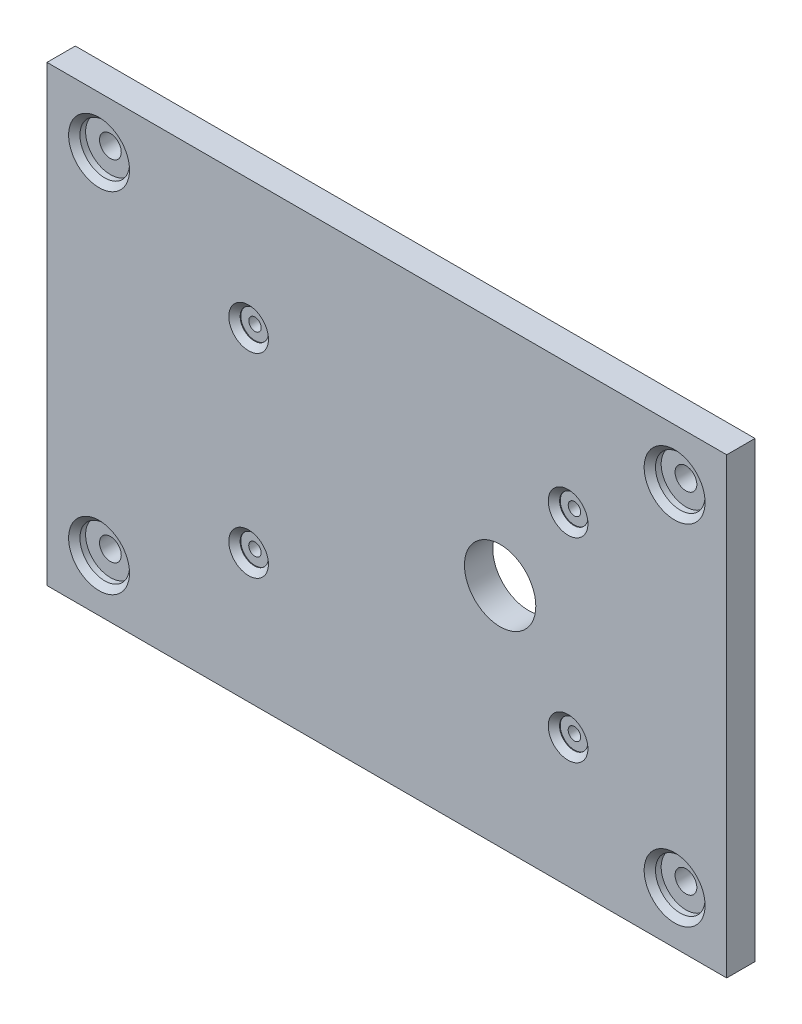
ISO-10303-21;
HEADER;
FILE_DESCRIPTION(('STEP AP214'),'2;1');
FILE_NAME('part.step','',(''),(''),'','','');
FILE_SCHEMA(('AUTOMOTIVE_DESIGN { 1 0 10303 214 1 1 1 1 }'));
ENDSEC;
DATA;
#1=APPLICATION_CONTEXT('core data for automotive mechanical design processes');
#2=APPLICATION_PROTOCOL_DEFINITION('international standard','automotive_design',2000,#1);
#3=PRODUCT_CONTEXT('',#1,'mechanical');
#4=PRODUCT('Part','Part','',(#3));
#5=PRODUCT_RELATED_PRODUCT_CATEGORY('part','',(#4));
#6=PRODUCT_DEFINITION_FORMATION('','',#4);
#7=PRODUCT_DEFINITION_CONTEXT('part definition',#1,'design');
#8=PRODUCT_DEFINITION('design','',#6,#7);
#9=PRODUCT_DEFINITION_SHAPE('','',#8);
#10=(LENGTH_UNIT() NAMED_UNIT(*) SI_UNIT(.MILLI.,.METRE.));
#11=(NAMED_UNIT(*) PLANE_ANGLE_UNIT() SI_UNIT($,.RADIAN.));
#12=(NAMED_UNIT(*) SI_UNIT($,.STERADIAN.) SOLID_ANGLE_UNIT());
#13=UNCERTAINTY_MEASURE_WITH_UNIT(LENGTH_MEASURE(1.E-05),#10,'distance_accuracy_value','');
#14=(GEOMETRIC_REPRESENTATION_CONTEXT(3) GLOBAL_UNCERTAINTY_ASSIGNED_CONTEXT((#13)) GLOBAL_UNIT_ASSIGNED_CONTEXT((#10,
#11,#12)) REPRESENTATION_CONTEXT('',''));
#15=CARTESIAN_POINT('',(0.,0.,0.));
#16=DIRECTION('',(0.,0.,1.));
#17=DIRECTION('',(1.,0.,0.));
#18=AXIS2_PLACEMENT_3D('',#15,#16,#17);
#19=CARTESIAN_POINT('',(0.,0.,3.175));
#20=DIRECTION('',(1.,0.,0.));
#21=DIRECTION('',(0.,0.,-1.));
#22=AXIS2_PLACEMENT_3D('',#19,#20,#21);
#23=PLANE('',#22);
#24=DIRECTION('',(0.,-1.,0.));
#25=VECTOR('',#24,1.);
#26=CARTESIAN_POINT('',(0.,0.,0.));
#27=LINE('',#26,#25);
#28=CARTESIAN_POINT('',(0.,50.8,0.));
#29=VERTEX_POINT('',#28);
#30=CARTESIAN_POINT('',(0.,0.,0.));
#31=VERTEX_POINT('',#30);
#32=EDGE_CURVE('E116',#29,#31,#27,.T.);
#33=ORIENTED_EDGE('',*,*,#32,.T.);
#34=DIRECTION('',(0.,0.,-1.));
#35=VECTOR('',#34,1.);
#36=CARTESIAN_POINT('',(0.,0.,3.175));
#37=LINE('',#36,#35);
#38=CARTESIAN_POINT('',(0.,0.,3.175));
#39=VERTEX_POINT('',#38);
#40=EDGE_CURVE('E11',#39,#31,#37,.T.);
#41=ORIENTED_EDGE('',*,*,#40,.F.);
#42=DIRECTION('',(0.,-1.,0.));
#43=VECTOR('',#42,1.);
#44=CARTESIAN_POINT('',(0.,0.,3.175));
#45=LINE('',#44,#43);
#46=CARTESIAN_POINT('',(0.,50.8,3.175));
#47=VERTEX_POINT('',#46);
#48=EDGE_CURVE('E99',#47,#39,#45,.T.);
#49=ORIENTED_EDGE('',*,*,#48,.F.);
#50=DIRECTION('',(0.,0.,-1.));
#51=VECTOR('',#50,1.);
#52=CARTESIAN_POINT('',(0.,50.8,3.175));
#53=LINE('',#52,#51);
#54=EDGE_CURVE('E112',#47,#29,#53,.T.);
#55=ORIENTED_EDGE('',*,*,#54,.T.);
#56=EDGE_LOOP('',(#33,#41,#49,#55));
#57=FACE_BOUND('',#56,.T.);
#58=ADVANCED_FACE('F45',(#57),#23,.F.);
#59=CARTESIAN_POINT('',(0.,0.,3.175));
#60=DIRECTION('',(0.,1.,0.));
#61=DIRECTION('',(0.,0.,1.));
#62=AXIS2_PLACEMENT_3D('',#59,#60,#61);
#63=PLANE('',#62);
#64=DIRECTION('',(1.,0.,0.));
#65=VECTOR('',#64,1.);
#66=CARTESIAN_POINT('',(0.,0.,0.));
#67=LINE('',#66,#65);
#68=CARTESIAN_POINT('',(76.2,0.,0.));
#69=VERTEX_POINT('',#68);
#70=EDGE_CURVE('E104',#31,#69,#67,.T.);
#71=ORIENTED_EDGE('',*,*,#70,.T.);
#72=DIRECTION('',(0.,0.,-1.));
#73=VECTOR('',#72,1.);
#74=CARTESIAN_POINT('',(76.2,0.,3.175));
#75=LINE('',#74,#73);
#76=CARTESIAN_POINT('',(76.2,0.,3.175));
#77=VERTEX_POINT('',#76);
#78=EDGE_CURVE('E55',#77,#69,#75,.T.);
#79=ORIENTED_EDGE('',*,*,#78,.F.);
#80=DIRECTION('',(1.,0.,0.));
#81=VECTOR('',#80,1.);
#82=CARTESIAN_POINT('',(0.,0.,3.175));
#83=LINE('',#82,#81);
#84=EDGE_CURVE('E94',#39,#77,#83,.T.);
#85=ORIENTED_EDGE('',*,*,#84,.F.);
#86=ORIENTED_EDGE('',*,*,#40,.T.);
#87=EDGE_LOOP('',(#71,#79,#85,#86));
#88=FACE_BOUND('',#87,.T.);
#89=ADVANCED_FACE('F103',(#88),#63,.F.);
#90=CARTESIAN_POINT('',(76.2,0.,3.175));
#91=DIRECTION('',(-1.,0.,0.));
#92=DIRECTION('',(0.,0.,1.));
#93=AXIS2_PLACEMENT_3D('',#90,#91,#92);
#94=PLANE('',#93);
#95=DIRECTION('',(0.,1.,0.));
#96=VECTOR('',#95,1.);
#97=CARTESIAN_POINT('',(76.2,0.,0.));
#98=LINE('',#97,#96);
#99=CARTESIAN_POINT('',(76.2,50.8,0.));
#100=VERTEX_POINT('',#99);
#101=EDGE_CURVE('E81',#69,#100,#98,.T.);
#102=ORIENTED_EDGE('',*,*,#101,.T.);
#103=DIRECTION('',(0.,0.,-1.));
#104=VECTOR('',#103,1.);
#105=CARTESIAN_POINT('',(76.2,50.8,3.175));
#106=LINE('',#105,#104);
#107=CARTESIAN_POINT('',(76.2,50.8,3.175));
#108=VERTEX_POINT('',#107);
#109=EDGE_CURVE('E106',#108,#100,#106,.T.);
#110=ORIENTED_EDGE('',*,*,#109,.F.);
#111=DIRECTION('',(0.,1.,0.));
#112=VECTOR('',#111,1.);
#113=CARTESIAN_POINT('',(76.2,0.,3.175));
#114=LINE('',#113,#112);
#115=EDGE_CURVE('E97',#77,#108,#114,.T.);
#116=ORIENTED_EDGE('',*,*,#115,.F.);
#117=ORIENTED_EDGE('',*,*,#78,.T.);
#118=EDGE_LOOP('',(#102,#110,#116,#117));
#119=FACE_BOUND('',#118,.T.);
#120=ADVANCED_FACE('F108',(#119),#94,.F.);
#121=CARTESIAN_POINT('',(0.,50.8,3.175));
#122=DIRECTION('',(0.,-1.,0.));
#123=DIRECTION('',(0.,0.,-1.));
#124=AXIS2_PLACEMENT_3D('',#121,#122,#123);
#125=PLANE('',#124);
#126=DIRECTION('',(-1.,0.,0.));
#127=VECTOR('',#126,1.);
#128=CARTESIAN_POINT('',(0.,50.8,0.));
#129=LINE('',#128,#127);
#130=EDGE_CURVE('E87',#100,#29,#129,.T.);
#131=ORIENTED_EDGE('',*,*,#130,.T.);
#132=ORIENTED_EDGE('',*,*,#54,.F.);
#133=DIRECTION('',(-1.,0.,0.));
#134=VECTOR('',#133,1.);
#135=CARTESIAN_POINT('',(0.,50.8,3.175));
#136=LINE('',#135,#134);
#137=EDGE_CURVE('E64',#108,#47,#136,.T.);
#138=ORIENTED_EDGE('',*,*,#137,.F.);
#139=ORIENTED_EDGE('',*,*,#109,.T.);
#140=EDGE_LOOP('',(#131,#132,#138,#139));
#141=FACE_BOUND('',#140,.T.);
#142=ADVANCED_FACE('F300',(#141),#125,.F.);
#143=CARTESIAN_POINT('',(0.,0.,3.175));
#144=DIRECTION('',(0.,0.,-1.));
#145=DIRECTION('',(-1.,0.,0.));
#146=AXIS2_PLACEMENT_3D('',#143,#144,#145);
#147=PLANE('',#146);
#148=CARTESIAN_POINT('',(22.6068122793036,36.3240964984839,3.175));
#149=DIRECTION('',(0.,0.,1.));
#150=DIRECTION('',(1.,0.,0.));
#151=AXIS2_PLACEMENT_3D('',#148,#149,#150);
#152=CIRCLE('',#151,2.2225);
#153=CARTESIAN_POINT('',(24.8293122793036,36.3240964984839,3.175));
#154=VERTEX_POINT('',#153);
#155=EDGE_CURVE('E638',#154,#154,#152,.T.);
#156=ORIENTED_EDGE('',*,*,#155,.F.);
#157=EDGE_LOOP('',(#156));
#158=FACE_BOUND('',#157,.T.);
#159=CARTESIAN_POINT('',(22.6030007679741,14.4857454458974,3.175));
#160=DIRECTION('',(0.,0.,1.));
#161=DIRECTION('',(1.,0.,0.));
#162=AXIS2_PLACEMENT_3D('',#159,#160,#161);
#163=CIRCLE('',#162,2.2225);
#164=CARTESIAN_POINT('',(24.8255007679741,14.4857454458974,3.175));
#165=VERTEX_POINT('',#164);
#166=EDGE_CURVE('E652',#165,#165,#163,.T.);
#167=ORIENTED_EDGE('',*,*,#166,.F.);
#168=EDGE_LOOP('',(#167));
#169=FACE_BOUND('',#168,.T.);
#170=CARTESIAN_POINT('',(58.4214304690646,36.3210018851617,3.175));
#171=DIRECTION('',(0.,0.,1.));
#172=DIRECTION('',(1.,0.,0.));
#173=AXIS2_PLACEMENT_3D('',#170,#171,#172);
#174=CIRCLE('',#173,2.2225);
#175=CARTESIAN_POINT('',(60.6439304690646,36.3210018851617,3.175));
#176=VERTEX_POINT('',#175);
#177=EDGE_CURVE('E167',#176,#176,#174,.T.);
#178=ORIENTED_EDGE('',*,*,#177,.F.);
#179=EDGE_LOOP('',(#178));
#180=FACE_BOUND('',#179,.T.);
#181=CARTESIAN_POINT('',(58.4176178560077,14.4763383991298,3.175));
#182=DIRECTION('',(0.,0.,1.));
#183=DIRECTION('',(1.,0.,0.));
#184=AXIS2_PLACEMENT_3D('',#181,#182,#183);
#185=CIRCLE('',#184,2.2225);
#186=CARTESIAN_POINT('',(60.6401178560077,14.4763383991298,3.175));
#187=VERTEX_POINT('',#186);
#188=EDGE_CURVE('E162',#187,#187,#185,.T.);
#189=ORIENTED_EDGE('',*,*,#188,.F.);
#190=EDGE_LOOP('',(#189));
#191=FACE_BOUND('',#190,.T.);
#192=CARTESIAN_POINT('',(50.8,25.4,3.175));
#193=DIRECTION('',(0.,0.,1.));
#194=DIRECTION('',(1.,0.,0.));
#195=AXIS2_PLACEMENT_3D('',#192,#193,#194);
#196=CIRCLE('',#195,4.0005);
#197=CARTESIAN_POINT('',(54.8005,25.4,3.175));
#198=VERTEX_POINT('',#197);
#199=EDGE_CURVE('E157',#198,#198,#196,.T.);
#200=ORIENTED_EDGE('',*,*,#199,.F.);
#201=EDGE_LOOP('',(#200));
#202=FACE_BOUND('',#201,.T.);
#203=CARTESIAN_POINT('',(5.83716647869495,44.9628335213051,3.175));
#204=DIRECTION('',(0.,0.,1.));
#205=DIRECTION('',(1.,0.,0.));
#206=AXIS2_PLACEMENT_3D('',#203,#204,#205);
#207=CIRCLE('',#206,3.41376);
#208=CARTESIAN_POINT('',(9.25092647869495,44.9628335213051,3.175));
#209=VERTEX_POINT('',#208);
#210=EDGE_CURVE('E215',#209,#209,#207,.T.);
#211=ORIENTED_EDGE('',*,*,#210,.F.);
#212=EDGE_LOOP('',(#211));
#213=FACE_BOUND('',#212,.T.);
#214=CARTESIAN_POINT('',(70.362833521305,44.9628335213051,3.175));
#215=DIRECTION('',(0.,0.,1.));
#216=DIRECTION('',(1.,0.,0.));
#217=AXIS2_PLACEMENT_3D('',#214,#215,#216);
#218=CIRCLE('',#217,3.41376);
#219=CARTESIAN_POINT('',(73.776593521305,44.9628335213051,3.175));
#220=VERTEX_POINT('',#219);
#221=EDGE_CURVE('E151',#220,#220,#218,.T.);
#222=ORIENTED_EDGE('',*,*,#221,.F.);
#223=EDGE_LOOP('',(#222));
#224=FACE_BOUND('',#223,.T.);
#225=CARTESIAN_POINT('',(5.83716647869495,5.83716647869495,3.175));
#226=DIRECTION('',(0.,0.,1.));
#227=DIRECTION('',(1.,0.,0.));
#228=AXIS2_PLACEMENT_3D('',#225,#226,#227);
#229=CIRCLE('',#228,3.41376);
#230=CARTESIAN_POINT('',(9.25092647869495,5.83716647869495,3.175));
#231=VERTEX_POINT('',#230);
#232=EDGE_CURVE('E145',#231,#231,#229,.T.);
#233=ORIENTED_EDGE('',*,*,#232,.F.);
#234=EDGE_LOOP('',(#233));
#235=FACE_BOUND('',#234,.T.);
#236=CARTESIAN_POINT('',(70.362833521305,5.83716647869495,3.175));
#237=DIRECTION('',(0.,0.,1.));
#238=DIRECTION('',(1.,0.,0.));
#239=AXIS2_PLACEMENT_3D('',#236,#237,#238);
#240=CIRCLE('',#239,3.41376);
#241=CARTESIAN_POINT('',(73.776593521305,5.83716647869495,3.175));
#242=VERTEX_POINT('',#241);
#243=EDGE_CURVE('E139',#242,#242,#240,.T.);
#244=ORIENTED_EDGE('',*,*,#243,.F.);
#245=EDGE_LOOP('',(#244));
#246=FACE_BOUND('',#245,.T.);
#247=ORIENTED_EDGE('',*,*,#48,.T.);
#248=ORIENTED_EDGE('',*,*,#84,.T.);
#249=ORIENTED_EDGE('',*,*,#115,.T.);
#250=ORIENTED_EDGE('',*,*,#137,.T.);
#251=EDGE_LOOP('',(#247,#248,#249,#250));
#252=FACE_BOUND('',#251,.T.);
#253=ADVANCED_FACE('F95',(#158,#169,#180,#191,#202,#213,#224,#235,#246,#252),#147,.F.);
#254=CARTESIAN_POINT('',(0.,0.,0.));
#255=DIRECTION('',(0.,0.,-1.));
#256=DIRECTION('',(-1.,0.,0.));
#257=AXIS2_PLACEMENT_3D('',#254,#255,#256);
#258=PLANE('',#257);
#259=CARTESIAN_POINT('',(22.6068122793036,36.3240964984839,0.));
#260=DIRECTION('',(0.,0.,-1.));
#261=DIRECTION('',(-1.,0.,0.));
#262=AXIS2_PLACEMENT_3D('',#259,#260,#261);
#263=CIRCLE('',#262,0.698499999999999);
#264=CARTESIAN_POINT('',(21.9083122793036,36.3240964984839,0.));
#265=VERTEX_POINT('',#264);
#266=EDGE_CURVE('E48',#265,#265,#263,.T.);
#267=ORIENTED_EDGE('',*,*,#266,.F.);
#268=EDGE_LOOP('',(#267));
#269=FACE_BOUND('',#268,.T.);
#270=CARTESIAN_POINT('',(22.6030007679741,14.4857454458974,0.));
#271=DIRECTION('',(0.,0.,-1.));
#272=DIRECTION('',(-1.,0.,0.));
#273=AXIS2_PLACEMENT_3D('',#270,#271,#272);
#274=CIRCLE('',#273,0.698499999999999);
#275=CARTESIAN_POINT('',(21.9045007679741,14.4857454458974,0.));
#276=VERTEX_POINT('',#275);
#277=EDGE_CURVE('E164',#276,#276,#274,.T.);
#278=ORIENTED_EDGE('',*,*,#277,.F.);
#279=EDGE_LOOP('',(#278));
#280=FACE_BOUND('',#279,.T.);
#281=CARTESIAN_POINT('',(58.4214304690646,36.3210018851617,0.));
#282=DIRECTION('',(0.,0.,-1.));
#283=DIRECTION('',(-1.,0.,0.));
#284=AXIS2_PLACEMENT_3D('',#281,#282,#283);
#285=CIRCLE('',#284,0.698500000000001);
#286=CARTESIAN_POINT('',(57.7229304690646,36.3210018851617,0.));
#287=VERTEX_POINT('',#286);
#288=EDGE_CURVE('E159',#287,#287,#285,.T.);
#289=ORIENTED_EDGE('',*,*,#288,.F.);
#290=EDGE_LOOP('',(#289));
#291=FACE_BOUND('',#290,.T.);
#292=CARTESIAN_POINT('',(58.4176178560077,14.4763383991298,0.));
#293=DIRECTION('',(0.,0.,-1.));
#294=DIRECTION('',(-1.,0.,0.));
#295=AXIS2_PLACEMENT_3D('',#292,#293,#294);
#296=CIRCLE('',#295,0.698500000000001);
#297=CARTESIAN_POINT('',(57.7191178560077,14.4763383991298,0.));
#298=VERTEX_POINT('',#297);
#299=EDGE_CURVE('E153',#298,#298,#296,.T.);
#300=ORIENTED_EDGE('',*,*,#299,.F.);
#301=EDGE_LOOP('',(#300));
#302=FACE_BOUND('',#301,.T.);
#303=CARTESIAN_POINT('',(50.8,25.4,0.));
#304=DIRECTION('',(0.,0.,1.));
#305=DIRECTION('',(1.,0.,0.));
#306=AXIS2_PLACEMENT_3D('',#303,#304,#305);
#307=CIRCLE('',#306,4.0005);
#308=CARTESIAN_POINT('',(54.8005,25.4,0.));
#309=VERTEX_POINT('',#308);
#310=EDGE_CURVE('E211',#309,#309,#307,.T.);
#311=ORIENTED_EDGE('',*,*,#310,.T.);
#312=EDGE_LOOP('',(#311));
#313=FACE_BOUND('',#312,.T.);
#314=CARTESIAN_POINT('',(5.83716647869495,44.9628335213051,0.));
#315=DIRECTION('',(0.,0.,-1.));
#316=DIRECTION('',(-1.,0.,0.));
#317=AXIS2_PLACEMENT_3D('',#314,#315,#316);
#318=CIRCLE('',#317,1.2192);
#319=CARTESIAN_POINT('',(4.61796647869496,44.9628335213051,0.));
#320=VERTEX_POINT('',#319);
#321=EDGE_CURVE('E147',#320,#320,#318,.T.);
#322=ORIENTED_EDGE('',*,*,#321,.F.);
#323=EDGE_LOOP('',(#322));
#324=FACE_BOUND('',#323,.T.);
#325=CARTESIAN_POINT('',(70.362833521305,44.9628335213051,0.));
#326=DIRECTION('',(0.,0.,-1.));
#327=DIRECTION('',(-1.,0.,0.));
#328=AXIS2_PLACEMENT_3D('',#325,#326,#327);
#329=CIRCLE('',#328,1.2192);
#330=CARTESIAN_POINT('',(69.143633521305,44.9628335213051,0.));
#331=VERTEX_POINT('',#330);
#332=EDGE_CURVE('E141',#331,#331,#329,.T.);
#333=ORIENTED_EDGE('',*,*,#332,.F.);
#334=EDGE_LOOP('',(#333));
#335=FACE_BOUND('',#334,.T.);
#336=CARTESIAN_POINT('',(5.83716647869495,5.83716647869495,0.));
#337=DIRECTION('',(0.,0.,-1.));
#338=DIRECTION('',(-1.,0.,0.));
#339=AXIS2_PLACEMENT_3D('',#336,#337,#338);
#340=CIRCLE('',#339,1.2192);
#341=CARTESIAN_POINT('',(4.61796647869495,5.83716647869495,0.));
#342=VERTEX_POINT('',#341);
#343=EDGE_CURVE('E135',#342,#342,#340,.T.);
#344=ORIENTED_EDGE('',*,*,#343,.F.);
#345=EDGE_LOOP('',(#344));
#346=FACE_BOUND('',#345,.T.);
#347=CARTESIAN_POINT('',(70.362833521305,5.83716647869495,0.));
#348=DIRECTION('',(0.,0.,-1.));
#349=DIRECTION('',(-1.,0.,0.));
#350=AXIS2_PLACEMENT_3D('',#347,#348,#349);
#351=CIRCLE('',#350,1.2192);
#352=CARTESIAN_POINT('',(69.143633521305,5.83716647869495,0.));
#353=VERTEX_POINT('',#352);
#354=EDGE_CURVE('E120',#353,#353,#351,.T.);
#355=ORIENTED_EDGE('',*,*,#354,.F.);
#356=EDGE_LOOP('',(#355));
#357=FACE_BOUND('',#356,.T.);
#358=ORIENTED_EDGE('',*,*,#32,.F.);
#359=ORIENTED_EDGE('',*,*,#130,.F.);
#360=ORIENTED_EDGE('',*,*,#101,.F.);
#361=ORIENTED_EDGE('',*,*,#70,.F.);
#362=EDGE_LOOP('',(#358,#359,#360,#361));
#363=FACE_BOUND('',#362,.T.);
#364=ADVANCED_FACE('F299',(#269,#280,#291,#302,#313,#324,#335,#346,#357,#363),#258,.T.);
#365=CARTESIAN_POINT('',(70.362833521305,5.83716647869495,3.175));
#366=DIRECTION('',(0.,0.,1.));
#367=DIRECTION('',(1.,0.,0.));
#368=AXIS2_PLACEMENT_3D('',#365,#366,#367);
#369=CYLINDRICAL_SURFACE('',#368,1.2192);
#370=ORIENTED_EDGE('',*,*,#354,.T.);
#371=EDGE_LOOP('',(#370));
#372=FACE_BOUND('',#371,.T.);
#373=CARTESIAN_POINT('',(70.362833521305,5.83716647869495,1.905));
#374=DIRECTION('',(0.,0.,1.));
#375=DIRECTION('',(1.,0.,0.));
#376=AXIS2_PLACEMENT_3D('',#373,#374,#375);
#377=CIRCLE('',#376,1.2192);
#378=CARTESIAN_POINT('',(71.582033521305,5.83716647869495,1.905));
#379=VERTEX_POINT('',#378);
#380=EDGE_CURVE('E134',#379,#379,#377,.T.);
#381=ORIENTED_EDGE('',*,*,#380,.T.);
#382=EDGE_LOOP('',(#381));
#383=FACE_BOUND('',#382,.T.);
#384=ADVANCED_FACE('F277',(#372,#383),#369,.F.);
#385=CARTESIAN_POINT('',(71.582033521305,5.83716647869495,1.905));
#386=DIRECTION('',(0.,0.,-1.));
#387=DIRECTION('',(-1.,0.,0.));
#388=AXIS2_PLACEMENT_3D('',#385,#386,#387);
#389=PLANE('',#388);
#390=ORIENTED_EDGE('',*,*,#380,.F.);
#391=EDGE_LOOP('',(#390));
#392=FACE_BOUND('',#391,.T.);
#393=CARTESIAN_POINT('',(70.362833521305,5.83716647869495,1.905));
#394=DIRECTION('',(0.,0.,1.));
#395=DIRECTION('',(1.,0.,0.));
#396=AXIS2_PLACEMENT_3D('',#393,#394,#395);
#397=CIRCLE('',#396,2.77876000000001);
#398=CARTESIAN_POINT('',(73.141593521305,5.83716647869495,1.905));
#399=VERTEX_POINT('',#398);
#400=EDGE_CURVE('E268',#399,#399,#397,.T.);
#401=ORIENTED_EDGE('',*,*,#400,.T.);
#402=EDGE_LOOP('',(#401));
#403=FACE_BOUND('',#402,.T.);
#404=ADVANCED_FACE('F279',(#392,#403),#389,.F.);
#405=CARTESIAN_POINT('',(70.362833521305,5.83716647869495,3.175));
#406=DIRECTION('',(0.,0.,1.));
#407=DIRECTION('',(1.,0.,0.));
#408=AXIS2_PLACEMENT_3D('',#405,#406,#407);
#409=CYLINDRICAL_SURFACE('',#408,2.77876000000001);
#410=ORIENTED_EDGE('',*,*,#400,.F.);
#411=EDGE_LOOP('',(#410));
#412=FACE_BOUND('',#411,.T.);
#413=CARTESIAN_POINT('',(70.362833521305,5.83716647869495,2.54));
#414=DIRECTION('',(0.,0.,1.));
#415=DIRECTION('',(1.,0.,0.));
#416=AXIS2_PLACEMENT_3D('',#413,#414,#415);
#417=CIRCLE('',#416,2.77876000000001);
#418=CARTESIAN_POINT('',(73.141593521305,5.83716647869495,2.54));
#419=VERTEX_POINT('',#418);
#420=EDGE_CURVE('E264',#419,#419,#417,.T.);
#421=ORIENTED_EDGE('',*,*,#420,.T.);
#422=EDGE_LOOP('',(#421));
#423=FACE_BOUND('',#422,.T.);
#424=ADVANCED_FACE('F282',(#412,#423),#409,.F.);
#425=CARTESIAN_POINT('',(70.362833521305,5.83716647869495,3.175));
#426=DIRECTION('',(0.,0.,1.));
#427=DIRECTION('',(1.,0.,0.));
#428=AXIS2_PLACEMENT_3D('',#425,#426,#427);
#429=CONICAL_SURFACE('',#428,3.41376,0.785398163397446);
#430=ORIENTED_EDGE('',*,*,#420,.F.);
#431=EDGE_LOOP('',(#430));
#432=FACE_BOUND('',#431,.T.);
#433=ORIENTED_EDGE('',*,*,#243,.T.);
#434=EDGE_LOOP('',(#433));
#435=FACE_BOUND('',#434,.T.);
#436=ADVANCED_FACE('F288',(#432,#435),#429,.F.);
#437=CARTESIAN_POINT('',(5.83716647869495,5.83716647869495,3.175));
#438=DIRECTION('',(0.,0.,1.));
#439=DIRECTION('',(1.,0.,0.));
#440=AXIS2_PLACEMENT_3D('',#437,#438,#439);
#441=CYLINDRICAL_SURFACE('',#440,1.2192);
#442=ORIENTED_EDGE('',*,*,#343,.T.);
#443=EDGE_LOOP('',(#442));
#444=FACE_BOUND('',#443,.T.);
#445=CARTESIAN_POINT('',(5.83716647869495,5.83716647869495,1.905));
#446=DIRECTION('',(0.,0.,1.));
#447=DIRECTION('',(1.,0.,0.));
#448=AXIS2_PLACEMENT_3D('',#445,#446,#447);
#449=CIRCLE('',#448,1.2192);
#450=CARTESIAN_POINT('',(7.05636647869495,5.83716647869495,1.905));
#451=VERTEX_POINT('',#450);
#452=EDGE_CURVE('E140',#451,#451,#449,.T.);
#453=ORIENTED_EDGE('',*,*,#452,.T.);
#454=EDGE_LOOP('',(#453));
#455=FACE_BOUND('',#454,.T.);
#456=ADVANCED_FACE('F294',(#444,#455),#441,.F.);
#457=CARTESIAN_POINT('',(7.05636647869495,5.83716647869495,1.905));
#458=DIRECTION('',(0.,0.,-1.));
#459=DIRECTION('',(-1.,0.,0.));
#460=AXIS2_PLACEMENT_3D('',#457,#458,#459);
#461=PLANE('',#460);
#462=ORIENTED_EDGE('',*,*,#452,.F.);
#463=EDGE_LOOP('',(#462));
#464=FACE_BOUND('',#463,.T.);
#465=CARTESIAN_POINT('',(5.83716647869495,5.83716647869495,1.905));
#466=DIRECTION('',(0.,0.,1.));
#467=DIRECTION('',(1.,0.,0.));
#468=AXIS2_PLACEMENT_3D('',#465,#466,#467);
#469=CIRCLE('',#468,2.77876);
#470=CARTESIAN_POINT('',(8.61592647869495,5.83716647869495,1.905));
#471=VERTEX_POINT('',#470);
#472=EDGE_CURVE('E254',#471,#471,#469,.T.);
#473=ORIENTED_EDGE('',*,*,#472,.T.);
#474=EDGE_LOOP('',(#473));
#475=FACE_BOUND('',#474,.T.);
#476=ADVANCED_FACE('F362',(#464,#475),#461,.F.);
#477=CARTESIAN_POINT('',(5.83716647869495,5.83716647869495,3.175));
#478=DIRECTION('',(0.,0.,1.));
#479=DIRECTION('',(1.,0.,0.));
#480=AXIS2_PLACEMENT_3D('',#477,#478,#479);
#481=CYLINDRICAL_SURFACE('',#480,2.77876);
#482=ORIENTED_EDGE('',*,*,#472,.F.);
#483=EDGE_LOOP('',(#482));
#484=FACE_BOUND('',#483,.T.);
#485=CARTESIAN_POINT('',(5.83716647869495,5.83716647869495,2.54));
#486=DIRECTION('',(0.,0.,1.));
#487=DIRECTION('',(1.,0.,0.));
#488=AXIS2_PLACEMENT_3D('',#485,#486,#487);
#489=CIRCLE('',#488,2.77876);
#490=CARTESIAN_POINT('',(8.61592647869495,5.83716647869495,2.54));
#491=VERTEX_POINT('',#490);
#492=EDGE_CURVE('E250',#491,#491,#489,.T.);
#493=ORIENTED_EDGE('',*,*,#492,.T.);
#494=EDGE_LOOP('',(#493));
#495=FACE_BOUND('',#494,.T.);
#496=ADVANCED_FACE('F371',(#484,#495),#481,.F.);
#497=CARTESIAN_POINT('',(5.83716647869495,5.83716647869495,3.175));
#498=DIRECTION('',(0.,0.,1.));
#499=DIRECTION('',(1.,0.,0.));
#500=AXIS2_PLACEMENT_3D('',#497,#498,#499);
#501=CONICAL_SURFACE('',#500,3.41376,0.785398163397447);
#502=ORIENTED_EDGE('',*,*,#492,.F.);
#503=EDGE_LOOP('',(#502));
#504=FACE_BOUND('',#503,.T.);
#505=ORIENTED_EDGE('',*,*,#232,.T.);
#506=EDGE_LOOP('',(#505));
#507=FACE_BOUND('',#506,.T.);
#508=ADVANCED_FACE('F380',(#504,#507),#501,.F.);
#509=CARTESIAN_POINT('',(70.362833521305,44.9628335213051,3.175));
#510=DIRECTION('',(0.,0.,1.));
#511=DIRECTION('',(1.,0.,0.));
#512=AXIS2_PLACEMENT_3D('',#509,#510,#511);
#513=CYLINDRICAL_SURFACE('',#512,1.2192);
#514=ORIENTED_EDGE('',*,*,#332,.T.);
#515=EDGE_LOOP('',(#514));
#516=FACE_BOUND('',#515,.T.);
#517=CARTESIAN_POINT('',(70.362833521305,44.9628335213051,1.905));
#518=DIRECTION('',(0.,0.,1.));
#519=DIRECTION('',(1.,0.,0.));
#520=AXIS2_PLACEMENT_3D('',#517,#518,#519);
#521=CIRCLE('',#520,1.2192);
#522=CARTESIAN_POINT('',(71.582033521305,44.9628335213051,1.905));
#523=VERTEX_POINT('',#522);
#524=EDGE_CURVE('E146',#523,#523,#521,.T.);
#525=ORIENTED_EDGE('',*,*,#524,.T.);
#526=EDGE_LOOP('',(#525));
#527=FACE_BOUND('',#526,.T.);
#528=ADVANCED_FACE('F389',(#516,#527),#513,.F.);
#529=CARTESIAN_POINT('',(71.582033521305,44.9628335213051,1.905));
#530=DIRECTION('',(0.,0.,-1.));
#531=DIRECTION('',(-1.,0.,0.));
#532=AXIS2_PLACEMENT_3D('',#529,#530,#531);
#533=PLANE('',#532);
#534=ORIENTED_EDGE('',*,*,#524,.F.);
#535=EDGE_LOOP('',(#534));
#536=FACE_BOUND('',#535,.T.);
#537=CARTESIAN_POINT('',(70.362833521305,44.9628335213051,1.905));
#538=DIRECTION('',(0.,0.,1.));
#539=DIRECTION('',(1.,0.,0.));
#540=AXIS2_PLACEMENT_3D('',#537,#538,#539);
#541=CIRCLE('',#540,2.77876000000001);
#542=CARTESIAN_POINT('',(73.141593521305,44.9628335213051,1.905));
#543=VERTEX_POINT('',#542);
#544=EDGE_CURVE('E240',#543,#543,#541,.T.);
#545=ORIENTED_EDGE('',*,*,#544,.T.);
#546=EDGE_LOOP('',(#545));
#547=FACE_BOUND('',#546,.T.);
#548=ADVANCED_FACE('F398',(#536,#547),#533,.F.);
#549=CARTESIAN_POINT('',(70.362833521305,44.9628335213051,3.175));
#550=DIRECTION('',(0.,0.,1.));
#551=DIRECTION('',(1.,0.,0.));
#552=AXIS2_PLACEMENT_3D('',#549,#550,#551);
#553=CYLINDRICAL_SURFACE('',#552,2.77876000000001);
#554=ORIENTED_EDGE('',*,*,#544,.F.);
#555=EDGE_LOOP('',(#554));
#556=FACE_BOUND('',#555,.T.);
#557=CARTESIAN_POINT('',(70.362833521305,44.9628335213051,2.54));
#558=DIRECTION('',(0.,0.,1.));
#559=DIRECTION('',(1.,0.,0.));
#560=AXIS2_PLACEMENT_3D('',#557,#558,#559);
#561=CIRCLE('',#560,2.77876000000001);
#562=CARTESIAN_POINT('',(73.141593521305,44.9628335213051,2.54));
#563=VERTEX_POINT('',#562);
#564=EDGE_CURVE('E236',#563,#563,#561,.T.);
#565=ORIENTED_EDGE('',*,*,#564,.T.);
#566=EDGE_LOOP('',(#565));
#567=FACE_BOUND('',#566,.T.);
#568=ADVANCED_FACE('F407',(#556,#567),#553,.F.);
#569=CARTESIAN_POINT('',(70.362833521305,44.9628335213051,3.175));
#570=DIRECTION('',(0.,0.,1.));
#571=DIRECTION('',(1.,0.,0.));
#572=AXIS2_PLACEMENT_3D('',#569,#570,#571);
#573=CONICAL_SURFACE('',#572,3.41376,0.785398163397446);
#574=ORIENTED_EDGE('',*,*,#564,.F.);
#575=EDGE_LOOP('',(#574));
#576=FACE_BOUND('',#575,.T.);
#577=ORIENTED_EDGE('',*,*,#221,.T.);
#578=EDGE_LOOP('',(#577));
#579=FACE_BOUND('',#578,.T.);
#580=ADVANCED_FACE('F416',(#576,#579),#573,.F.);
#581=CARTESIAN_POINT('',(5.83716647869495,44.9628335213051,3.175));
#582=DIRECTION('',(0.,0.,1.));
#583=DIRECTION('',(1.,0.,0.));
#584=AXIS2_PLACEMENT_3D('',#581,#582,#583);
#585=CYLINDRICAL_SURFACE('',#584,1.2192);
#586=ORIENTED_EDGE('',*,*,#321,.T.);
#587=EDGE_LOOP('',(#586));
#588=FACE_BOUND('',#587,.T.);
#589=CARTESIAN_POINT('',(5.83716647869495,44.9628335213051,1.905));
#590=DIRECTION('',(0.,0.,1.));
#591=DIRECTION('',(1.,0.,0.));
#592=AXIS2_PLACEMENT_3D('',#589,#590,#591);
#593=CIRCLE('',#592,1.2192);
#594=CARTESIAN_POINT('',(7.05636647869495,44.9628335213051,1.905));
#595=VERTEX_POINT('',#594);
#596=EDGE_CURVE('E152',#595,#595,#593,.T.);
#597=ORIENTED_EDGE('',*,*,#596,.T.);
#598=EDGE_LOOP('',(#597));
#599=FACE_BOUND('',#598,.T.);
#600=ADVANCED_FACE('F425',(#588,#599),#585,.F.);
#601=CARTESIAN_POINT('',(7.05636647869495,44.9628335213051,1.905));
#602=DIRECTION('',(0.,0.,-1.));
#603=DIRECTION('',(-1.,0.,0.));
#604=AXIS2_PLACEMENT_3D('',#601,#602,#603);
#605=PLANE('',#604);
#606=ORIENTED_EDGE('',*,*,#596,.F.);
#607=EDGE_LOOP('',(#606));
#608=FACE_BOUND('',#607,.T.);
#609=CARTESIAN_POINT('',(5.83716647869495,44.9628335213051,1.905));
#610=DIRECTION('',(0.,0.,1.));
#611=DIRECTION('',(1.,0.,0.));
#612=AXIS2_PLACEMENT_3D('',#609,#610,#611);
#613=CIRCLE('',#612,2.77876);
#614=CARTESIAN_POINT('',(8.61592647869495,44.9628335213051,1.905));
#615=VERTEX_POINT('',#614);
#616=EDGE_CURVE('E226',#615,#615,#613,.T.);
#617=ORIENTED_EDGE('',*,*,#616,.T.);
#618=EDGE_LOOP('',(#617));
#619=FACE_BOUND('',#618,.T.);
#620=ADVANCED_FACE('F434',(#608,#619),#605,.F.);
#621=CARTESIAN_POINT('',(5.83716647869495,44.9628335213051,3.175));
#622=DIRECTION('',(0.,0.,1.));
#623=DIRECTION('',(1.,0.,0.));
#624=AXIS2_PLACEMENT_3D('',#621,#622,#623);
#625=CYLINDRICAL_SURFACE('',#624,2.77876);
#626=ORIENTED_EDGE('',*,*,#616,.F.);
#627=EDGE_LOOP('',(#626));
#628=FACE_BOUND('',#627,.T.);
#629=CARTESIAN_POINT('',(5.83716647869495,44.9628335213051,2.54));
#630=DIRECTION('',(0.,0.,1.));
#631=DIRECTION('',(1.,0.,0.));
#632=AXIS2_PLACEMENT_3D('',#629,#630,#631);
#633=CIRCLE('',#632,2.77876);
#634=CARTESIAN_POINT('',(8.61592647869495,44.9628335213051,2.54));
#635=VERTEX_POINT('',#634);
#636=EDGE_CURVE('E222',#635,#635,#633,.T.);
#637=ORIENTED_EDGE('',*,*,#636,.T.);
#638=EDGE_LOOP('',(#637));
#639=FACE_BOUND('',#638,.T.);
#640=ADVANCED_FACE('F443',(#628,#639),#625,.F.);
#641=CARTESIAN_POINT('',(5.83716647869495,44.9628335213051,3.175));
#642=DIRECTION('',(0.,0.,1.));
#643=DIRECTION('',(1.,0.,0.));
#644=AXIS2_PLACEMENT_3D('',#641,#642,#643);
#645=CONICAL_SURFACE('',#644,3.41376,0.785398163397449);
#646=ORIENTED_EDGE('',*,*,#636,.F.);
#647=EDGE_LOOP('',(#646));
#648=FACE_BOUND('',#647,.T.);
#649=ORIENTED_EDGE('',*,*,#210,.T.);
#650=EDGE_LOOP('',(#649));
#651=FACE_BOUND('',#650,.T.);
#652=ADVANCED_FACE('F452',(#648,#651),#645,.F.);
#653=CARTESIAN_POINT('',(50.8,25.4,0.));
#654=DIRECTION('',(0.,0.,1.));
#655=DIRECTION('',(1.,0.,0.));
#656=AXIS2_PLACEMENT_3D('',#653,#654,#655);
#657=CYLINDRICAL_SURFACE('',#656,4.0005);
#658=ORIENTED_EDGE('',*,*,#310,.F.);
#659=EDGE_LOOP('',(#658));
#660=FACE_BOUND('',#659,.T.);
#661=ORIENTED_EDGE('',*,*,#199,.T.);
#662=EDGE_LOOP('',(#661));
#663=FACE_BOUND('',#662,.T.);
#664=ADVANCED_FACE('F460',(#660,#663),#657,.F.);
#665=CARTESIAN_POINT('',(58.4176178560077,14.4763383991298,3.175));
#666=DIRECTION('',(0.,0.,1.));
#667=DIRECTION('',(1.,0.,0.));
#668=AXIS2_PLACEMENT_3D('',#665,#666,#667);
#669=CYLINDRICAL_SURFACE('',#668,0.698500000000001);
#670=ORIENTED_EDGE('',*,*,#299,.T.);
#671=EDGE_LOOP('',(#670));
#672=FACE_BOUND('',#671,.T.);
#673=CARTESIAN_POINT('',(58.4176178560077,14.4763383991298,2.4638));
#674=DIRECTION('',(0.,0.,1.));
#675=DIRECTION('',(1.,0.,0.));
#676=AXIS2_PLACEMENT_3D('',#673,#674,#675);
#677=CIRCLE('',#676,0.698500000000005);
#678=CARTESIAN_POINT('',(59.1161178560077,14.4763383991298,2.4638));
#679=VERTEX_POINT('',#678);
#680=EDGE_CURVE('E158',#679,#679,#677,.T.);
#681=ORIENTED_EDGE('',*,*,#680,.T.);
#682=EDGE_LOOP('',(#681));
#683=FACE_BOUND('',#682,.T.);
#684=ADVANCED_FACE('F468',(#672,#683),#669,.F.);
#685=CARTESIAN_POINT('',(59.1161178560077,14.4763383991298,2.4638));
#686=DIRECTION('',(0.,0.,-1.));
#687=DIRECTION('',(-1.,0.,0.));
#688=AXIS2_PLACEMENT_3D('',#685,#686,#687);
#689=PLANE('',#688);
#690=ORIENTED_EDGE('',*,*,#680,.F.);
#691=EDGE_LOOP('',(#690));
#692=FACE_BOUND('',#691,.T.);
#693=CARTESIAN_POINT('',(58.4176178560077,14.4763383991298,2.4638));
#694=DIRECTION('',(0.,0.,1.));
#695=DIRECTION('',(1.,0.,0.));
#696=AXIS2_PLACEMENT_3D('',#693,#694,#695);
#697=CIRCLE('',#696,1.5875);
#698=CARTESIAN_POINT('',(60.0051178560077,14.4763383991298,2.4638));
#699=VERTEX_POINT('',#698);
#700=EDGE_CURVE('E204',#699,#699,#697,.T.);
#701=ORIENTED_EDGE('',*,*,#700,.T.);
#702=EDGE_LOOP('',(#701));
#703=FACE_BOUND('',#702,.T.);
#704=ADVANCED_FACE('F481',(#692,#703),#689,.F.);
#705=CARTESIAN_POINT('',(58.4176178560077,14.4763383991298,3.175));
#706=DIRECTION('',(0.,0.,1.));
#707=DIRECTION('',(1.,0.,0.));
#708=AXIS2_PLACEMENT_3D('',#705,#706,#707);
#709=CYLINDRICAL_SURFACE('',#708,1.5875);
#710=ORIENTED_EDGE('',*,*,#700,.F.);
#711=EDGE_LOOP('',(#710));
#712=FACE_BOUND('',#711,.T.);
#713=CARTESIAN_POINT('',(58.4176178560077,14.4763383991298,2.54));
#714=DIRECTION('',(0.,0.,1.));
#715=DIRECTION('',(1.,0.,0.));
#716=AXIS2_PLACEMENT_3D('',#713,#714,#715);
#717=CIRCLE('',#716,1.5875);
#718=CARTESIAN_POINT('',(60.0051178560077,14.4763383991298,2.54));
#719=VERTEX_POINT('',#718);
#720=EDGE_CURVE('E200',#719,#719,#717,.T.);
#721=ORIENTED_EDGE('',*,*,#720,.T.);
#722=EDGE_LOOP('',(#721));
#723=FACE_BOUND('',#722,.T.);
#724=ADVANCED_FACE('F491',(#712,#723),#709,.F.);
#725=CARTESIAN_POINT('',(58.4176178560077,14.4763383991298,3.175));
#726=DIRECTION('',(0.,0.,1.));
#727=DIRECTION('',(1.,0.,0.));
#728=AXIS2_PLACEMENT_3D('',#725,#726,#727);
#729=CONICAL_SURFACE('',#728,2.2225,0.785398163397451);
#730=ORIENTED_EDGE('',*,*,#720,.F.);
#731=EDGE_LOOP('',(#730));
#732=FACE_BOUND('',#731,.T.);
#733=ORIENTED_EDGE('',*,*,#188,.T.);
#734=EDGE_LOOP('',(#733));
#735=FACE_BOUND('',#734,.T.);
#736=ADVANCED_FACE('F501',(#732,#735),#729,.F.);
#737=CARTESIAN_POINT('',(58.4214304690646,36.3210018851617,3.175));
#738=DIRECTION('',(0.,0.,1.));
#739=DIRECTION('',(1.,0.,0.));
#740=AXIS2_PLACEMENT_3D('',#737,#738,#739);
#741=CYLINDRICAL_SURFACE('',#740,0.698500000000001);
#742=ORIENTED_EDGE('',*,*,#288,.T.);
#743=EDGE_LOOP('',(#742));
#744=FACE_BOUND('',#743,.T.);
#745=CARTESIAN_POINT('',(58.4214304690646,36.3210018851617,2.4638));
#746=DIRECTION('',(0.,0.,1.));
#747=DIRECTION('',(1.,0.,0.));
#748=AXIS2_PLACEMENT_3D('',#745,#746,#747);
#749=CIRCLE('',#748,0.698500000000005);
#750=CARTESIAN_POINT('',(59.1199304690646,36.3210018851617,2.4638));
#751=VERTEX_POINT('',#750);
#752=EDGE_CURVE('E163',#751,#751,#749,.T.);
#753=ORIENTED_EDGE('',*,*,#752,.T.);
#754=EDGE_LOOP('',(#753));
#755=FACE_BOUND('',#754,.T.);
#756=ADVANCED_FACE('F511',(#744,#755),#741,.F.);
#757=CARTESIAN_POINT('',(59.1199304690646,36.3210018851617,2.4638));
#758=DIRECTION('',(0.,0.,-1.));
#759=DIRECTION('',(-1.,0.,0.));
#760=AXIS2_PLACEMENT_3D('',#757,#758,#759);
#761=PLANE('',#760);
#762=ORIENTED_EDGE('',*,*,#752,.F.);
#763=EDGE_LOOP('',(#762));
#764=FACE_BOUND('',#763,.T.);
#765=CARTESIAN_POINT('',(58.4214304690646,36.3210018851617,2.4638));
#766=DIRECTION('',(0.,0.,1.));
#767=DIRECTION('',(1.,0.,0.));
#768=AXIS2_PLACEMENT_3D('',#765,#766,#767);
#769=CIRCLE('',#768,1.5875);
#770=CARTESIAN_POINT('',(60.0089304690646,36.3210018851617,2.4638));
#771=VERTEX_POINT('',#770);
#772=EDGE_CURVE('E190',#771,#771,#769,.T.);
#773=ORIENTED_EDGE('',*,*,#772,.T.);
#774=EDGE_LOOP('',(#773));
#775=FACE_BOUND('',#774,.T.);
#776=ADVANCED_FACE('F521',(#764,#775),#761,.F.);
#777=CARTESIAN_POINT('',(58.4214304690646,36.3210018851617,3.175));
#778=DIRECTION('',(0.,0.,1.));
#779=DIRECTION('',(1.,0.,0.));
#780=AXIS2_PLACEMENT_3D('',#777,#778,#779);
#781=CYLINDRICAL_SURFACE('',#780,1.5875);
#782=ORIENTED_EDGE('',*,*,#772,.F.);
#783=EDGE_LOOP('',(#782));
#784=FACE_BOUND('',#783,.T.);
#785=CARTESIAN_POINT('',(58.4214304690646,36.3210018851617,2.54));
#786=DIRECTION('',(0.,0.,1.));
#787=DIRECTION('',(1.,0.,0.));
#788=AXIS2_PLACEMENT_3D('',#785,#786,#787);
#789=CIRCLE('',#788,1.5875);
#790=CARTESIAN_POINT('',(60.0089304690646,36.3210018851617,2.54));
#791=VERTEX_POINT('',#790);
#792=EDGE_CURVE('E174',#791,#791,#789,.T.);
#793=ORIENTED_EDGE('',*,*,#792,.T.);
#794=EDGE_LOOP('',(#793));
#795=FACE_BOUND('',#794,.T.);
#796=ADVANCED_FACE('F531',(#784,#795),#781,.F.);
#797=CARTESIAN_POINT('',(58.4214304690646,36.3210018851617,3.175));
#798=DIRECTION('',(0.,0.,1.));
#799=DIRECTION('',(1.,0.,0.));
#800=AXIS2_PLACEMENT_3D('',#797,#798,#799);
#801=CONICAL_SURFACE('',#800,2.2225,0.785398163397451);
#802=ORIENTED_EDGE('',*,*,#792,.F.);
#803=EDGE_LOOP('',(#802));
#804=FACE_BOUND('',#803,.T.);
#805=ORIENTED_EDGE('',*,*,#177,.T.);
#806=EDGE_LOOP('',(#805));
#807=FACE_BOUND('',#806,.T.);
#808=ADVANCED_FACE('F541',(#804,#807),#801,.F.);
#809=CARTESIAN_POINT('',(22.6030007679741,14.4857454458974,3.175));
#810=DIRECTION('',(0.,0.,1.));
#811=DIRECTION('',(1.,0.,0.));
#812=AXIS2_PLACEMENT_3D('',#809,#810,#811);
#813=CYLINDRICAL_SURFACE('',#812,0.698499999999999);
#814=ORIENTED_EDGE('',*,*,#277,.T.);
#815=EDGE_LOOP('',(#814));
#816=FACE_BOUND('',#815,.T.);
#817=CARTESIAN_POINT('',(22.6030007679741,14.4857454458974,2.4638));
#818=DIRECTION('',(0.,0.,1.));
#819=DIRECTION('',(1.,0.,0.));
#820=AXIS2_PLACEMENT_3D('',#817,#818,#819);
#821=CIRCLE('',#820,0.698500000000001);
#822=CARTESIAN_POINT('',(23.3015007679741,14.4857454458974,2.4638));
#823=VERTEX_POINT('',#822);
#824=EDGE_CURVE('E168',#823,#823,#821,.T.);
#825=ORIENTED_EDGE('',*,*,#824,.T.);
#826=EDGE_LOOP('',(#825));
#827=FACE_BOUND('',#826,.T.);
#828=ADVANCED_FACE('F551',(#816,#827),#813,.F.);
#829=CARTESIAN_POINT('',(23.3015007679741,14.4857454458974,2.4638));
#830=DIRECTION('',(0.,0.,-1.));
#831=DIRECTION('',(-1.,0.,0.));
#832=AXIS2_PLACEMENT_3D('',#829,#830,#831);
#833=PLANE('',#832);
#834=ORIENTED_EDGE('',*,*,#824,.F.);
#835=EDGE_LOOP('',(#834));
#836=FACE_BOUND('',#835,.T.);
#837=CARTESIAN_POINT('',(22.6030007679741,14.4857454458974,2.4638));
#838=DIRECTION('',(0.,0.,1.));
#839=DIRECTION('',(1.,0.,0.));
#840=AXIS2_PLACEMENT_3D('',#837,#838,#839);
#841=CIRCLE('',#840,1.5875);
#842=CARTESIAN_POINT('',(24.1905007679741,14.4857454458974,2.4638));
#843=VERTEX_POINT('',#842);
#844=EDGE_CURVE('E177',#843,#843,#841,.T.);
#845=ORIENTED_EDGE('',*,*,#844,.T.);
#846=EDGE_LOOP('',(#845));
#847=FACE_BOUND('',#846,.T.);
#848=ADVANCED_FACE('F561',(#836,#847),#833,.F.);
#849=CARTESIAN_POINT('',(22.6030007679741,14.4857454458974,3.175));
#850=DIRECTION('',(0.,0.,1.));
#851=DIRECTION('',(1.,0.,0.));
#852=AXIS2_PLACEMENT_3D('',#849,#850,#851);
#853=CYLINDRICAL_SURFACE('',#852,1.5875);
#854=ORIENTED_EDGE('',*,*,#844,.F.);
#855=EDGE_LOOP('',(#854));
#856=FACE_BOUND('',#855,.T.);
#857=CARTESIAN_POINT('',(22.6030007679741,14.4857454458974,2.54));
#858=DIRECTION('',(0.,0.,1.));
#859=DIRECTION('',(1.,0.,0.));
#860=AXIS2_PLACEMENT_3D('',#857,#858,#859);
#861=CIRCLE('',#860,1.5875);
#862=CARTESIAN_POINT('',(24.1905007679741,14.4857454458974,2.54));
#863=VERTEX_POINT('',#862);
#864=EDGE_CURVE('E183',#863,#863,#861,.T.);
#865=ORIENTED_EDGE('',*,*,#864,.T.);
#866=EDGE_LOOP('',(#865));
#867=FACE_BOUND('',#866,.T.);
#868=ADVANCED_FACE('F570',(#856,#867),#853,.F.);
#869=CARTESIAN_POINT('',(22.6030007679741,14.4857454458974,3.175));
#870=DIRECTION('',(0.,0.,1.));
#871=DIRECTION('',(1.,0.,0.));
#872=AXIS2_PLACEMENT_3D('',#869,#870,#871);
#873=CONICAL_SURFACE('',#872,2.2225,0.785398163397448);
#874=ORIENTED_EDGE('',*,*,#864,.F.);
#875=EDGE_LOOP('',(#874));
#876=FACE_BOUND('',#875,.T.);
#877=ORIENTED_EDGE('',*,*,#166,.T.);
#878=EDGE_LOOP('',(#877));
#879=FACE_BOUND('',#878,.T.);
#880=ADVANCED_FACE('F580',(#876,#879),#873,.F.);
#881=CARTESIAN_POINT('',(22.6068122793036,36.3240964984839,3.175));
#882=DIRECTION('',(0.,0.,1.));
#883=DIRECTION('',(1.,0.,0.));
#884=AXIS2_PLACEMENT_3D('',#881,#882,#883);
#885=CYLINDRICAL_SURFACE('',#884,0.698499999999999);
#886=ORIENTED_EDGE('',*,*,#266,.T.);
#887=EDGE_LOOP('',(#886));
#888=FACE_BOUND('',#887,.T.);
#889=CARTESIAN_POINT('',(22.6068122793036,36.3240964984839,2.4638));
#890=DIRECTION('',(0.,0.,1.));
#891=DIRECTION('',(1.,0.,0.));
#892=AXIS2_PLACEMENT_3D('',#889,#890,#891);
#893=CIRCLE('',#892,0.698500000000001);
#894=CARTESIAN_POINT('',(23.3053122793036,36.3240964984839,2.4638));
#895=VERTEX_POINT('',#894);
#896=EDGE_CURVE('E648',#895,#895,#893,.T.);
#897=ORIENTED_EDGE('',*,*,#896,.T.);
#898=EDGE_LOOP('',(#897));
#899=FACE_BOUND('',#898,.T.);
#900=ADVANCED_FACE('F590',(#888,#899),#885,.F.);
#901=CARTESIAN_POINT('',(23.3053122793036,36.3240964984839,2.4638));
#902=DIRECTION('',(0.,0.,-1.));
#903=DIRECTION('',(-1.,0.,0.));
#904=AXIS2_PLACEMENT_3D('',#901,#902,#903);
#905=PLANE('',#904);
#906=ORIENTED_EDGE('',*,*,#896,.F.);
#907=EDGE_LOOP('',(#906));
#908=FACE_BOUND('',#907,.T.);
#909=CARTESIAN_POINT('',(22.6068122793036,36.3240964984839,2.4638));
#910=DIRECTION('',(0.,0.,1.));
#911=DIRECTION('',(1.,0.,0.));
#912=AXIS2_PLACEMENT_3D('',#909,#910,#911);
#913=CIRCLE('',#912,1.5875);
#914=CARTESIAN_POINT('',(24.1943122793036,36.3240964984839,2.4638));
#915=VERTEX_POINT('',#914);
#916=EDGE_CURVE('E642',#915,#915,#913,.T.);
#917=ORIENTED_EDGE('',*,*,#916,.T.);
#918=EDGE_LOOP('',(#917));
#919=FACE_BOUND('',#918,.T.);
#920=ADVANCED_FACE('F600',(#908,#919),#905,.F.);
#921=CARTESIAN_POINT('',(22.6068122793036,36.3240964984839,3.175));
#922=DIRECTION('',(0.,0.,1.));
#923=DIRECTION('',(1.,0.,0.));
#924=AXIS2_PLACEMENT_3D('',#921,#922,#923);
#925=CYLINDRICAL_SURFACE('',#924,1.5875);
#926=ORIENTED_EDGE('',*,*,#916,.F.);
#927=EDGE_LOOP('',(#926));
#928=FACE_BOUND('',#927,.T.);
#929=CARTESIAN_POINT('',(22.6068122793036,36.3240964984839,2.54));
#930=DIRECTION('',(0.,0.,1.));
#931=DIRECTION('',(1.,0.,0.));
#932=AXIS2_PLACEMENT_3D('',#929,#930,#931);
#933=CIRCLE('',#932,1.5875);
#934=CARTESIAN_POINT('',(24.1943122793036,36.3240964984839,2.54));
#935=VERTEX_POINT('',#934);
#936=EDGE_CURVE('E636',#935,#935,#933,.T.);
#937=ORIENTED_EDGE('',*,*,#936,.T.);
#938=EDGE_LOOP('',(#937));
#939=FACE_BOUND('',#938,.T.);
#940=ADVANCED_FACE('F610',(#928,#939),#925,.F.);
#941=CARTESIAN_POINT('',(22.6068122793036,36.3240964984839,3.175));
#942=DIRECTION('',(0.,0.,1.));
#943=DIRECTION('',(1.,0.,0.));
#944=AXIS2_PLACEMENT_3D('',#941,#942,#943);
#945=CONICAL_SURFACE('',#944,2.2225,0.785398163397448);
#946=ORIENTED_EDGE('',*,*,#936,.F.);
#947=EDGE_LOOP('',(#946));
#948=FACE_BOUND('',#947,.T.);
#949=ORIENTED_EDGE('',*,*,#155,.T.);
#950=EDGE_LOOP('',(#949));
#951=FACE_BOUND('',#950,.T.);
#952=ADVANCED_FACE('F620',(#948,#951),#945,.F.);
#953=CLOSED_SHELL('',(#58,#89,#120,#142,#253,#364,#384,#404,#424,#436,#456,#476,#496,#508,#528,
#548,#568,#580,#600,#620,#640,#652,#664,#684,#704,#724,#736,#756,#776,#796,#808,#828,#848,#868,
#880,#900,#920,#940,#952));
#954=MANIFOLD_SOLID_BREP('B2',#953);
#955=ADVANCED_BREP_SHAPE_REPRESENTATION('',(#18,#954),#14);
#956=SHAPE_DEFINITION_REPRESENTATION(#9,#955);
ENDSEC;
END-ISO-10303-21;
